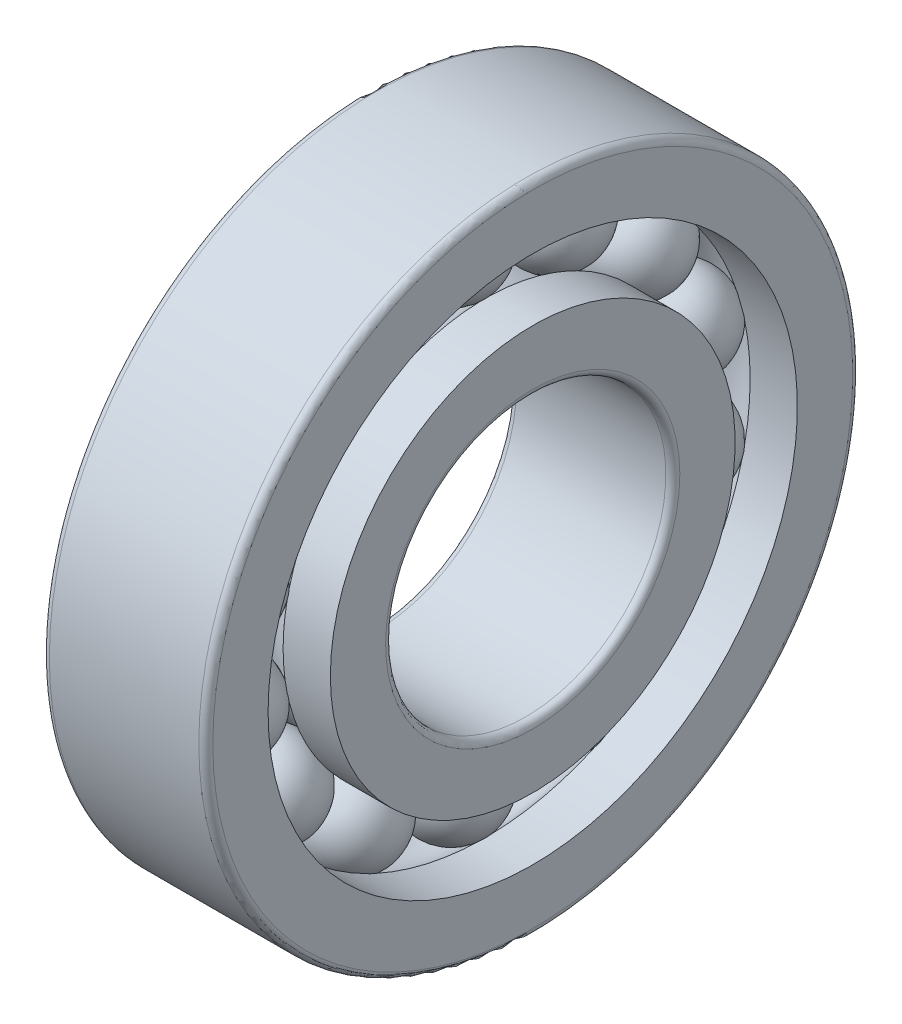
from build123d import *

# Parameters (mm, degrees)
CIRCULAR_PATTERN1_COUNT = 14
FILLET1_R               = 0.3


with BuildPart() as part:
    # Sketch1 → Revolve1 (revolve)
    with BuildSketch(Plane.XY):
        with BuildLine():
            Line((-2, 10), (2, 10))
            ThreePointArc((2, 10), (0, 12), (-2, 10))
        make_face()
    revolve1 = revolve(axis=Axis((-4.596601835, 10, 0), (1, 0, 0)))

    # Sketch2 → Revolve2 (revolve)
    with BuildSketch(Plane.XY, mode=Mode.PRIVATE) as revolve2_sk:
        with BuildLine():
            Line((-3.5, 8.666666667), (-3.5, 6))
            Line((-3.5, 6), (3.5, 6))
            Line((3.5, 6), (3.5, 8.666666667))
            Line((3.5, 8.666666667), (1.4772685, 8.666666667))
            ThreePointArc((1.4772685, 8.666666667), (0, 8.01), (-1.4772685, 8.666666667))
            Line((-1.4772685, 8.666666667), (-3.5, 8.666666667))
        make_face()
    revolve(revolve2_sk.sketch.rotate(Axis((-6.971390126, 0, 0), (1, 0, 0)), 90), axis=Axis((-6.971390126, 0, 0), (1, 0, 0)))

    # Sketch3 → Revolve3 (revolve)
    with BuildSketch(Plane.XY, mode=Mode.PRIVATE) as revolve3_sk:
        with BuildLine():
            Line((-3.5, 14), (3.5, 14))
            Line((3.5, 14), (3.5, 11.333333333))
            Line((3.5, 11.333333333), (1.4772685, 11.333333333))
            ThreePointArc((1.4772685, 11.333333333), (0, 11.99), (-1.4772685, 11.333333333))
            Line((-1.4772685, 11.333333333), (-3.5, 11.333333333))
            Line((-3.5, 11.333333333), (-3.5, 14))
        make_face()
    revolve(revolve3_sk.sketch.rotate(Axis((-8.710676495, 0, 0), (1, 0, 0)), 90), axis=Axis((-8.710676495, 0, 0), (1, 0, 0)))

    # Circular-Pattern1: Revolve1 ×14 about axis
    circular_pattern1_axis = Axis((0, 0, 0), (1, 0, 0))
    for i in range(1, CIRCULAR_PATTERN1_COUNT):
        add(revolve1.rotate(circular_pattern1_axis, i * 360 / CIRCULAR_PATTERN1_COUNT))

    # Fillet1
    fillet1_edges = [part.edges().sort_by_distance(p)[0] for p in [
        (-3.5, 0, -14),
        (3.5, 0, -14),
        (-3.5, 0, -6),
        (3.5, 0, -6),
    ]]
    fillet(fillet1_edges, radius=FILLET1_R)


solid = part.part
